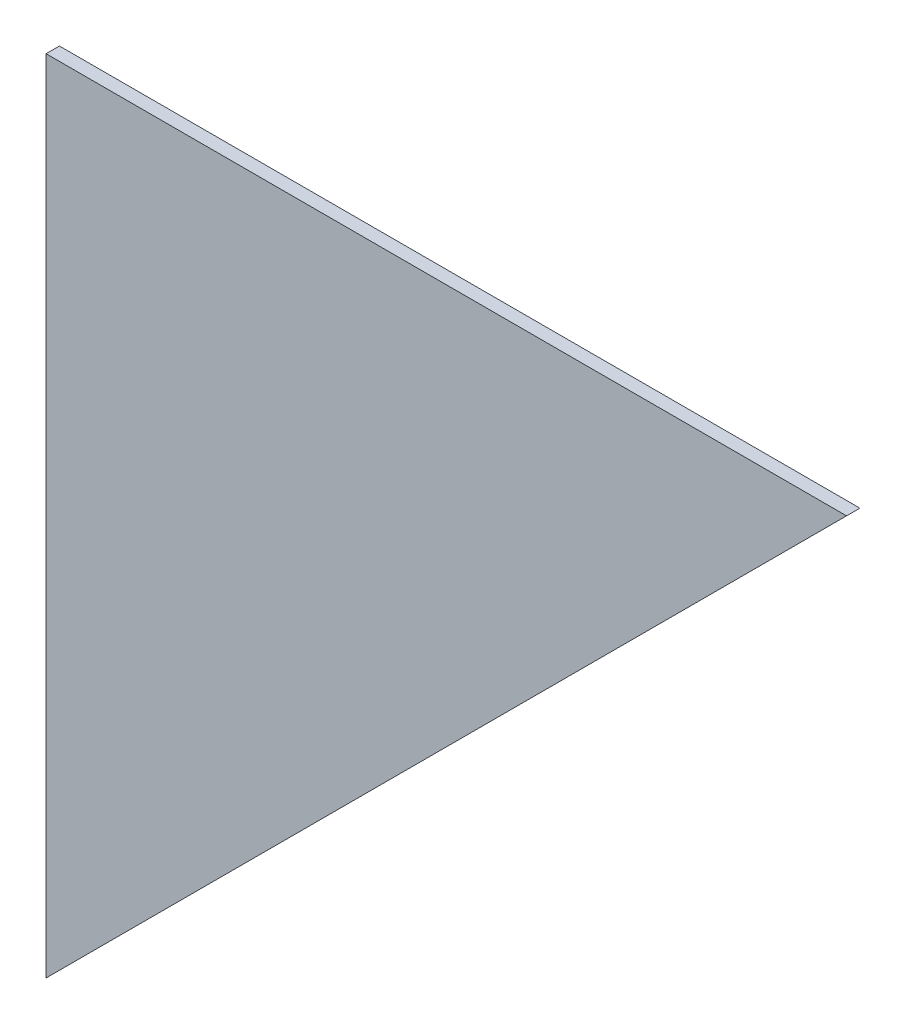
ISO-10303-21;
HEADER;
FILE_DESCRIPTION(('STEP AP214'),'2;1');
FILE_NAME('part.step','',(''),(''),'','','');
FILE_SCHEMA(('AUTOMOTIVE_DESIGN { 1 0 10303 214 1 1 1 1 }'));
ENDSEC;
DATA;
#1=APPLICATION_CONTEXT('core data for automotive mechanical design processes');
#2=APPLICATION_PROTOCOL_DEFINITION('international standard','automotive_design',2000,#1);
#3=PRODUCT_CONTEXT('',#1,'mechanical');
#4=PRODUCT('Part','Part','',(#3));
#5=PRODUCT_RELATED_PRODUCT_CATEGORY('part','',(#4));
#6=PRODUCT_DEFINITION_FORMATION('','',#4);
#7=PRODUCT_DEFINITION_CONTEXT('part definition',#1,'design');
#8=PRODUCT_DEFINITION('design','',#6,#7);
#9=PRODUCT_DEFINITION_SHAPE('','',#8);
#10=(LENGTH_UNIT() NAMED_UNIT(*) SI_UNIT(.MILLI.,.METRE.));
#11=(NAMED_UNIT(*) PLANE_ANGLE_UNIT() SI_UNIT($,.RADIAN.));
#12=(NAMED_UNIT(*) SI_UNIT($,.STERADIAN.) SOLID_ANGLE_UNIT());
#13=UNCERTAINTY_MEASURE_WITH_UNIT(LENGTH_MEASURE(1.E-05),#10,'distance_accuracy_value','');
#14=(GEOMETRIC_REPRESENTATION_CONTEXT(3) GLOBAL_UNCERTAINTY_ASSIGNED_CONTEXT((#13)) GLOBAL_UNIT_ASSIGNED_CONTEXT((#10,
#11,#12)) REPRESENTATION_CONTEXT('',''));
#15=CARTESIAN_POINT('',(0.,0.,0.));
#16=DIRECTION('',(0.,0.,1.));
#17=DIRECTION('',(1.,0.,0.));
#18=AXIS2_PLACEMENT_3D('',#15,#16,#17);
#19=CARTESIAN_POINT('',(0.,0.,2.54));
#20=DIRECTION('',(1.,0.,0.));
#21=DIRECTION('',(0.,1.,0.));
#22=AXIS2_PLACEMENT_3D('',#19,#20,#21);
#23=PLANE('',#22);
#24=DIRECTION('',(0.,-1.,0.));
#25=VECTOR('',#24,1.);
#26=CARTESIAN_POINT('',(0.,0.,0.));
#27=LINE('',#26,#25);
#28=CARTESIAN_POINT('',(0.,0.,0.));
#29=VERTEX_POINT('',#28);
#30=CARTESIAN_POINT('',(0.,-152.4,0.));
#31=VERTEX_POINT('',#30);
#32=EDGE_CURVE('E83',#29,#31,#27,.T.);
#33=ORIENTED_EDGE('',*,*,#32,.T.);
#34=DIRECTION('',(0.,0.,-1.));
#35=VECTOR('',#34,1.);
#36=CARTESIAN_POINT('',(0.,-152.4,2.54));
#37=LINE('',#36,#35);
#38=CARTESIAN_POINT('',(0.,-152.4,2.54));
#39=VERTEX_POINT('',#38);
#40=EDGE_CURVE('E11',#39,#31,#37,.T.);
#41=ORIENTED_EDGE('',*,*,#40,.F.);
#42=DIRECTION('',(0.,-1.,0.));
#43=VECTOR('',#42,1.);
#44=CARTESIAN_POINT('',(0.,0.,2.54));
#45=LINE('',#44,#43);
#46=CARTESIAN_POINT('',(0.,0.,2.54));
#47=VERTEX_POINT('',#46);
#48=EDGE_CURVE('E76',#47,#39,#45,.T.);
#49=ORIENTED_EDGE('',*,*,#48,.F.);
#50=DIRECTION('',(0.,0.,-1.));
#51=VECTOR('',#50,1.);
#52=CARTESIAN_POINT('',(0.,0.,2.54));
#53=LINE('',#52,#51);
#54=EDGE_CURVE('E84',#47,#29,#53,.T.);
#55=ORIENTED_EDGE('',*,*,#54,.T.);
#56=EDGE_LOOP('',(#33,#41,#49,#55));
#57=FACE_BOUND('',#56,.T.);
#58=ADVANCED_FACE('F36',(#57),#23,.F.);
#59=CARTESIAN_POINT('',(0.,-152.4,2.54));
#60=DIRECTION('',(-0.707106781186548,0.707106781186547,0.));
#61=DIRECTION('',(-0.707106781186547,-0.707106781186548,0.));
#62=AXIS2_PLACEMENT_3D('',#59,#60,#61);
#63=PLANE('',#62);
#64=DIRECTION('',(0.707106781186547,0.707106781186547,0.));
#65=VECTOR('',#64,1.);
#66=CARTESIAN_POINT('',(0.,-152.4,0.));
#67=LINE('',#66,#65);
#68=CARTESIAN_POINT('',(152.4,0.,0.));
#69=VERTEX_POINT('',#68);
#70=EDGE_CURVE('E64',#31,#69,#67,.T.);
#71=ORIENTED_EDGE('',*,*,#70,.T.);
#72=DIRECTION('',(0.,0.,-1.));
#73=VECTOR('',#72,1.);
#74=CARTESIAN_POINT('',(152.4,0.,2.54));
#75=LINE('',#74,#73);
#76=CARTESIAN_POINT('',(152.4,0.,2.54));
#77=VERTEX_POINT('',#76);
#78=EDGE_CURVE('E44',#77,#69,#75,.T.);
#79=ORIENTED_EDGE('',*,*,#78,.F.);
#80=DIRECTION('',(0.707106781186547,0.707106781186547,0.));
#81=VECTOR('',#80,1.);
#82=CARTESIAN_POINT('',(0.,-152.4,2.54));
#83=LINE('',#82,#81);
#84=EDGE_CURVE('E72',#39,#77,#83,.T.);
#85=ORIENTED_EDGE('',*,*,#84,.F.);
#86=ORIENTED_EDGE('',*,*,#40,.T.);
#87=EDGE_LOOP('',(#71,#79,#85,#86));
#88=FACE_BOUND('',#87,.T.);
#89=ADVANCED_FACE('F73',(#88),#63,.F.);
#90=CARTESIAN_POINT('',(0.,0.,2.54));
#91=DIRECTION('',(0.,-1.,0.));
#92=DIRECTION('',(0.,0.,-1.));
#93=AXIS2_PLACEMENT_3D('',#90,#91,#92);
#94=PLANE('',#93);
#95=DIRECTION('',(-1.,0.,0.));
#96=VECTOR('',#95,1.);
#97=CARTESIAN_POINT('',(0.,0.,0.));
#98=LINE('',#97,#96);
#99=EDGE_CURVE('E69',#69,#29,#98,.T.);
#100=ORIENTED_EDGE('',*,*,#99,.T.);
#101=ORIENTED_EDGE('',*,*,#54,.F.);
#102=DIRECTION('',(-1.,0.,0.));
#103=VECTOR('',#102,1.);
#104=CARTESIAN_POINT('',(0.,0.,2.54));
#105=LINE('',#104,#103);
#106=EDGE_CURVE('E52',#77,#47,#105,.T.);
#107=ORIENTED_EDGE('',*,*,#106,.F.);
#108=ORIENTED_EDGE('',*,*,#78,.T.);
#109=EDGE_LOOP('',(#100,#101,#107,#108));
#110=FACE_BOUND('',#109,.T.);
#111=ADVANCED_FACE('F91',(#110),#94,.F.);
#112=CARTESIAN_POINT('',(0.,0.,2.54));
#113=DIRECTION('',(0.,0.,1.));
#114=DIRECTION('',(1.,0.,0.));
#115=AXIS2_PLACEMENT_3D('',#112,#113,#114);
#116=PLANE('',#115);
#117=ORIENTED_EDGE('',*,*,#48,.T.);
#118=ORIENTED_EDGE('',*,*,#84,.T.);
#119=ORIENTED_EDGE('',*,*,#106,.T.);
#120=EDGE_LOOP('',(#117,#118,#119));
#121=FACE_BOUND('',#120,.T.);
#122=ADVANCED_FACE('F79',(#121),#116,.T.);
#123=CARTESIAN_POINT('',(0.,0.,0.));
#124=DIRECTION('',(0.,0.,1.));
#125=DIRECTION('',(1.,0.,0.));
#126=AXIS2_PLACEMENT_3D('',#123,#124,#125);
#127=PLANE('',#126);
#128=ORIENTED_EDGE('',*,*,#32,.F.);
#129=ORIENTED_EDGE('',*,*,#99,.F.);
#130=ORIENTED_EDGE('',*,*,#70,.F.);
#131=EDGE_LOOP('',(#128,#129,#130));
#132=FACE_BOUND('',#131,.T.);
#133=ADVANCED_FACE('F92',(#132),#127,.F.);
#134=CLOSED_SHELL('',(#58,#89,#111,#122,#133));
#135=MANIFOLD_SOLID_BREP('B2',#134);
#136=ADVANCED_BREP_SHAPE_REPRESENTATION('',(#18,#135),#14);
#137=SHAPE_DEFINITION_REPRESENTATION(#9,#136);
ENDSEC;
END-ISO-10303-21;
